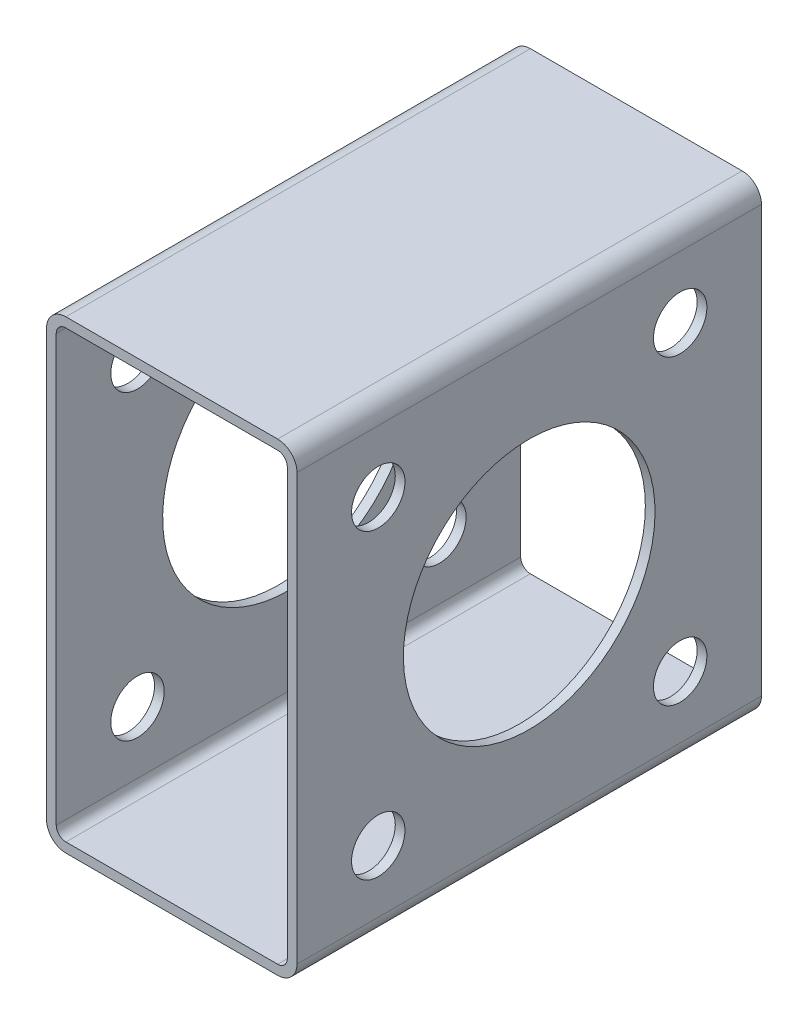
from build123d import *

# Parameters (mm, degrees)
CHANNEL_DEPTH = 152.4
HOLES1_REACH  = 191.166
SKETCH2_R     = 41.275
SKETCH2_R_2   = 8.763
HOLES2_REACH  = 191.166
SKETCH4_R     = 41.275
SKETCH4_R_2   = 8.763


with BuildPart() as part:
    # Sketch1 → CHANNEL (new body)
    with BuildSketch(Plane.XY):
        with BuildLine():
            Line((-31.75, -76.2), (37.719, -76.2))
            ThreePointArc((37.719, -76.2), (42.209128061, -74.340128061), (44.069, -69.85))
            Line((44.069, -69.85), (44.069, 69.85))
            ThreePointArc((44.069, 69.85), (42.209128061, 74.340128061), (37.719, 76.2))
            Line((37.719, 76.2), (-31.75, 76.2))
            ThreePointArc((-31.75, 76.2), (-36.240128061, 74.340128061), (-38.1, 69.85))
            Line((-38.1, 69.85), (-38.1, -69.85))
            ThreePointArc((-38.1, -69.85), (-36.240128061, -74.340128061), (-31.75, -76.2))
        make_face()
        with BuildLine():
            Line((-34.925, -69.85), (-34.925, 69.85))
            ThreePointArc((-34.925, 69.85), (-33.99506403, 72.09506403), (-31.75, 73.025))
            Line((-31.75, 73.025), (37.719, 73.025))
            ThreePointArc((37.719, 73.025), (39.96406403, 72.09506403), (40.894, 69.85))
            Line((40.894, 69.85), (40.894, -69.85))
            ThreePointArc((40.894, -69.85), (39.96406403, -72.09506403), (37.719, -73.025))
            Line((37.719, -73.025), (-31.75, -73.025))
            ThreePointArc((-31.75, -73.025), (-33.99506403, -72.09506403), (-34.925, -69.85))
        make_face(mode=Mode.SUBTRACT)
    extrude(amount=CHANNEL_DEPTH)

    # Sketch2 → HOLES1 (cut, up to next)
    with BuildSketch(Plane(origin=(44.069, 0, 0), x_dir=(0, 0, -1), z_dir=(1, 0, 0)), mode=Mode.PRIVATE) as holes1_sk1:
        with Locations(Location((-76.2, 0, 0), (0, 0, 90))):
            Circle(SKETCH2_R)
    holes1_tool1 = extrude(holes1_sk1.sketch, amount=-HOLES1_REACH, mode=Mode.PRIVATE) & part.part
    # Sketch2 → HOLES1 (cut, up to next)
    with BuildSketch(Plane(origin=(44.069, 0, 0), x_dir=(0, 0, -1), z_dir=(1, 0, 0)), mode=Mode.PRIVATE) as holes1_sk2:
        with Locations(Location((-125.73, 49.53, 0), (0, 0, 90))):
            Circle(SKETCH2_R_2)
    holes1_tool2 = extrude(holes1_sk2.sketch, amount=-HOLES1_REACH, mode=Mode.PRIVATE) & part.part
    # Sketch2 → HOLES1 (cut, up to next)
    with BuildSketch(Plane(origin=(44.069, 0, 0), x_dir=(0, 0, -1), z_dir=(1, 0, 0)), mode=Mode.PRIVATE) as holes1_sk3:
        with Locations(Location((-26.67, 49.53, 0), (0, 0, 90))):
            Circle(SKETCH2_R_2)
    holes1_tool3 = extrude(holes1_sk3.sketch, amount=-HOLES1_REACH, mode=Mode.PRIVATE) & part.part
    # Sketch2 → HOLES1 (cut, up to next)
    with BuildSketch(Plane(origin=(44.069, 0, 0), x_dir=(0, 0, -1), z_dir=(1, 0, 0)), mode=Mode.PRIVATE) as holes1_sk4:
        with Locations(Location((-26.67, -49.53, 0), (0, 0, 90))):
            Circle(SKETCH2_R_2)
    holes1_tool4 = extrude(holes1_sk4.sketch, amount=-HOLES1_REACH, mode=Mode.PRIVATE) & part.part
    # Sketch2 → HOLES1 (cut, up to next)
    with BuildSketch(Plane(origin=(44.069, 0, 0), x_dir=(0, 0, -1), z_dir=(1, 0, 0)), mode=Mode.PRIVATE) as holes1_sk5:
        with Locations(Location((-125.73, -49.53, 0), (0, 0, 90))):
            Circle(SKETCH2_R_2)
    holes1_tool5 = extrude(holes1_sk5.sketch, amount=-HOLES1_REACH, mode=Mode.PRIVATE) & part.part
    add(holes1_tool1.solids().sort_by_distance((44.069, 0, 76.2))[0], mode=Mode.SUBTRACT)
    add(holes1_tool2.solids().sort_by_distance((44.069, 49.53, 125.73))[0], mode=Mode.SUBTRACT)
    add(holes1_tool3.solids().sort_by_distance((44.069, 49.53, 26.67))[0], mode=Mode.SUBTRACT)
    add(holes1_tool4.solids().sort_by_distance((44.069, -49.53, 26.67))[0], mode=Mode.SUBTRACT)
    add(holes1_tool5.solids().sort_by_distance((44.069, -49.53, 125.73))[0], mode=Mode.SUBTRACT)

    # Sketch4 → HOLES2 (cut, up to next)
    with BuildSketch(Plane.ZY.offset(38.1), mode=Mode.PRIVATE) as holes2_sk1:
        with Locations(Location((76.2, 0, 0), (0, 0, 90))):
            Circle(SKETCH4_R)
    holes2_tool1 = extrude(holes2_sk1.sketch, amount=-HOLES2_REACH, mode=Mode.PRIVATE) & part.part
    # Sketch4 → HOLES2 (cut, up to next)
    with BuildSketch(Plane.ZY.offset(38.1), mode=Mode.PRIVATE) as holes2_sk2:
        with Locations(Location((26.67, 49.53, 0), (0, 0, 90))):
            Circle(SKETCH4_R_2)
    holes2_tool2 = extrude(holes2_sk2.sketch, amount=-HOLES2_REACH, mode=Mode.PRIVATE) & part.part
    # Sketch4 → HOLES2 (cut, up to next)
    with BuildSketch(Plane.ZY.offset(38.1), mode=Mode.PRIVATE) as holes2_sk3:
        with Locations(Location((125.73, 49.53, 0), (0, 0, 90))):
            Circle(SKETCH4_R_2)
    holes2_tool3 = extrude(holes2_sk3.sketch, amount=-HOLES2_REACH, mode=Mode.PRIVATE) & part.part
    # Sketch4 → HOLES2 (cut, up to next)
    with BuildSketch(Plane.ZY.offset(38.1), mode=Mode.PRIVATE) as holes2_sk4:
        with Locations(Location((26.67, -49.53, 0), (0, 0, 90))):
            Circle(SKETCH4_R_2)
    holes2_tool4 = extrude(holes2_sk4.sketch, amount=-HOLES2_REACH, mode=Mode.PRIVATE) & part.part
    # Sketch4 → HOLES2 (cut, up to next)
    with BuildSketch(Plane.ZY.offset(38.1), mode=Mode.PRIVATE) as holes2_sk5:
        with Locations(Location((125.73, -49.53, 0), (0, 0, 90))):
            Circle(SKETCH4_R_2)
    holes2_tool5 = extrude(holes2_sk5.sketch, amount=-HOLES2_REACH, mode=Mode.PRIVATE) & part.part
    add(holes2_tool1.solids().sort_by_distance((-38.1, 0, 76.2))[0], mode=Mode.SUBTRACT)
    add(holes2_tool2.solids().sort_by_distance((-38.1, 49.53, 26.67))[0], mode=Mode.SUBTRACT)
    add(holes2_tool3.solids().sort_by_distance((-38.1, 49.53, 125.73))[0], mode=Mode.SUBTRACT)
    add(holes2_tool4.solids().sort_by_distance((-38.1, -49.53, 26.67))[0], mode=Mode.SUBTRACT)
    add(holes2_tool5.solids().sort_by_distance((-38.1, -49.53, 125.73))[0], mode=Mode.SUBTRACT)


solid = part.part
